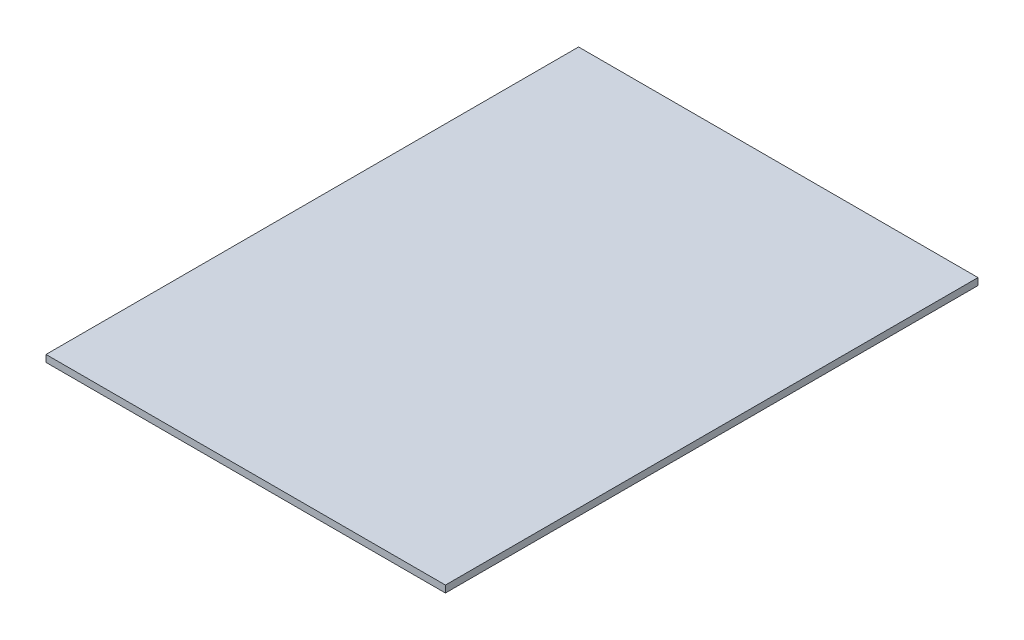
ISO-10303-21;
HEADER;
FILE_DESCRIPTION(('STEP AP214'),'2;1');
FILE_NAME('part.step','',(''),(''),'','','');
FILE_SCHEMA(('AUTOMOTIVE_DESIGN { 1 0 10303 214 1 1 1 1 }'));
ENDSEC;
DATA;
#1=APPLICATION_CONTEXT('core data for automotive mechanical design processes');
#2=APPLICATION_PROTOCOL_DEFINITION('international standard','automotive_design',2000,#1);
#3=PRODUCT_CONTEXT('',#1,'mechanical');
#4=PRODUCT('Part','Part','',(#3));
#5=PRODUCT_RELATED_PRODUCT_CATEGORY('part','',(#4));
#6=PRODUCT_DEFINITION_FORMATION('','',#4);
#7=PRODUCT_DEFINITION_CONTEXT('part definition',#1,'design');
#8=PRODUCT_DEFINITION('design','',#6,#7);
#9=PRODUCT_DEFINITION_SHAPE('','',#8);
#10=(LENGTH_UNIT() NAMED_UNIT(*) SI_UNIT(.MILLI.,.METRE.));
#11=(NAMED_UNIT(*) PLANE_ANGLE_UNIT() SI_UNIT($,.RADIAN.));
#12=(NAMED_UNIT(*) SI_UNIT($,.STERADIAN.) SOLID_ANGLE_UNIT());
#13=UNCERTAINTY_MEASURE_WITH_UNIT(LENGTH_MEASURE(1.E-05),#10,'distance_accuracy_value','');
#14=(GEOMETRIC_REPRESENTATION_CONTEXT(3) GLOBAL_UNCERTAINTY_ASSIGNED_CONTEXT((#13)) GLOBAL_UNIT_ASSIGNED_CONTEXT((#10,
#11,#12)) REPRESENTATION_CONTEXT('',''));
#15=CARTESIAN_POINT('',(0.,0.,0.));
#16=DIRECTION('',(0.,0.,1.));
#17=DIRECTION('',(1.,0.,0.));
#18=AXIS2_PLACEMENT_3D('',#15,#16,#17);
#19=CARTESIAN_POINT('',(342.9,11.90625,457.2));
#20=DIRECTION('',(-1.,0.,0.));
#21=DIRECTION('',(0.,0.,1.));
#22=AXIS2_PLACEMENT_3D('',#19,#20,#21);
#23=PLANE('',#22);
#24=DIRECTION('',(0.,0.,-1.));
#25=VECTOR('',#24,1.);
#26=CARTESIAN_POINT('',(342.9,0.,457.2));
#27=LINE('',#26,#25);
#28=CARTESIAN_POINT('',(342.9,0.,457.2));
#29=VERTEX_POINT('',#28);
#30=CARTESIAN_POINT('',(342.9,0.,-457.2));
#31=VERTEX_POINT('',#30);
#32=EDGE_CURVE('E95',#29,#31,#27,.T.);
#33=ORIENTED_EDGE('',*,*,#32,.T.);
#34=DIRECTION('',(0.,-1.,0.));
#35=VECTOR('',#34,1.);
#36=CARTESIAN_POINT('',(342.9,11.90625,-457.2));
#37=LINE('',#36,#35);
#38=CARTESIAN_POINT('',(342.9,11.90625,-457.2));
#39=VERTEX_POINT('',#38);
#40=EDGE_CURVE('E11',#39,#31,#37,.T.);
#41=ORIENTED_EDGE('',*,*,#40,.F.);
#42=DIRECTION('',(0.,0.,-1.));
#43=VECTOR('',#42,1.);
#44=CARTESIAN_POINT('',(342.9,11.90625,457.2));
#45=LINE('',#44,#43);
#46=CARTESIAN_POINT('',(342.9,11.90625,457.2));
#47=VERTEX_POINT('',#46);
#48=EDGE_CURVE('E83',#47,#39,#45,.T.);
#49=ORIENTED_EDGE('',*,*,#48,.F.);
#50=DIRECTION('',(0.,-1.,0.));
#51=VECTOR('',#50,1.);
#52=CARTESIAN_POINT('',(342.9,11.90625,457.2));
#53=LINE('',#52,#51);
#54=EDGE_CURVE('E91',#47,#29,#53,.T.);
#55=ORIENTED_EDGE('',*,*,#54,.T.);
#56=EDGE_LOOP('',(#33,#41,#49,#55));
#57=FACE_BOUND('',#56,.T.);
#58=ADVANCED_FACE('F32',(#57),#23,.F.);
#59=CARTESIAN_POINT('',(-342.9,11.90625,-457.2));
#60=DIRECTION('',(0.,0.,1.));
#61=DIRECTION('',(1.,0.,0.));
#62=AXIS2_PLACEMENT_3D('',#59,#60,#61);
#63=PLANE('',#62);
#64=DIRECTION('',(-1.,0.,0.));
#65=VECTOR('',#64,1.);
#66=CARTESIAN_POINT('',(-342.9,0.,-457.2));
#67=LINE('',#66,#65);
#68=CARTESIAN_POINT('',(-342.9,0.,-457.2));
#69=VERTEX_POINT('',#68);
#70=EDGE_CURVE('E87',#31,#69,#67,.T.);
#71=ORIENTED_EDGE('',*,*,#70,.T.);
#72=DIRECTION('',(0.,-1.,0.));
#73=VECTOR('',#72,1.);
#74=CARTESIAN_POINT('',(-342.9,11.90625,-457.2));
#75=LINE('',#74,#73);
#76=CARTESIAN_POINT('',(-342.9,11.90625,-457.2));
#77=VERTEX_POINT('',#76);
#78=EDGE_CURVE('E40',#77,#69,#75,.T.);
#79=ORIENTED_EDGE('',*,*,#78,.F.);
#80=DIRECTION('',(-1.,0.,0.));
#81=VECTOR('',#80,1.);
#82=CARTESIAN_POINT('',(-342.9,11.90625,-457.2));
#83=LINE('',#82,#81);
#84=EDGE_CURVE('E78',#39,#77,#83,.T.);
#85=ORIENTED_EDGE('',*,*,#84,.F.);
#86=ORIENTED_EDGE('',*,*,#40,.T.);
#87=EDGE_LOOP('',(#71,#79,#85,#86));
#88=FACE_BOUND('',#87,.T.);
#89=ADVANCED_FACE('F86',(#88),#63,.F.);
#90=CARTESIAN_POINT('',(-342.9,11.90625,457.2));
#91=DIRECTION('',(1.,0.,0.));
#92=DIRECTION('',(0.,0.,-1.));
#93=AXIS2_PLACEMENT_3D('',#90,#91,#92);
#94=PLANE('',#93);
#95=DIRECTION('',(0.,0.,1.));
#96=VECTOR('',#95,1.);
#97=CARTESIAN_POINT('',(-342.9,0.,457.2));
#98=LINE('',#97,#96);
#99=CARTESIAN_POINT('',(-342.9,0.,457.2));
#100=VERTEX_POINT('',#99);
#101=EDGE_CURVE('E65',#69,#100,#98,.T.);
#102=ORIENTED_EDGE('',*,*,#101,.T.);
#103=DIRECTION('',(0.,-1.,0.));
#104=VECTOR('',#103,1.);
#105=CARTESIAN_POINT('',(-342.9,11.90625,457.2));
#106=LINE('',#105,#104);
#107=CARTESIAN_POINT('',(-342.9,11.90625,457.2));
#108=VERTEX_POINT('',#107);
#109=EDGE_CURVE('E88',#108,#100,#106,.T.);
#110=ORIENTED_EDGE('',*,*,#109,.F.);
#111=DIRECTION('',(0.,0.,1.));
#112=VECTOR('',#111,1.);
#113=CARTESIAN_POINT('',(-342.9,11.90625,457.2));
#114=LINE('',#113,#112);
#115=EDGE_CURVE('E81',#77,#108,#114,.T.);
#116=ORIENTED_EDGE('',*,*,#115,.F.);
#117=ORIENTED_EDGE('',*,*,#78,.T.);
#118=EDGE_LOOP('',(#102,#110,#116,#117));
#119=FACE_BOUND('',#118,.T.);
#120=ADVANCED_FACE('F89',(#119),#94,.F.);
#121=CARTESIAN_POINT('',(-342.9,11.90625,457.2));
#122=DIRECTION('',(0.,0.,-1.));
#123=DIRECTION('',(-1.,0.,0.));
#124=AXIS2_PLACEMENT_3D('',#121,#122,#123);
#125=PLANE('',#124);
#126=DIRECTION('',(1.,0.,0.));
#127=VECTOR('',#126,1.);
#128=CARTESIAN_POINT('',(-342.9,0.,457.2));
#129=LINE('',#128,#127);
#130=EDGE_CURVE('E71',#100,#29,#129,.T.);
#131=ORIENTED_EDGE('',*,*,#130,.T.);
#132=ORIENTED_EDGE('',*,*,#54,.F.);
#133=DIRECTION('',(1.,0.,0.));
#134=VECTOR('',#133,1.);
#135=CARTESIAN_POINT('',(-342.9,11.90625,457.2));
#136=LINE('',#135,#134);
#137=EDGE_CURVE('E48',#108,#47,#136,.T.);
#138=ORIENTED_EDGE('',*,*,#137,.F.);
#139=ORIENTED_EDGE('',*,*,#109,.T.);
#140=EDGE_LOOP('',(#131,#132,#138,#139));
#141=FACE_BOUND('',#140,.T.);
#142=ADVANCED_FACE('F102',(#141),#125,.F.);
#143=CARTESIAN_POINT('',(0.,11.90625,0.));
#144=DIRECTION('',(0.,-1.,0.));
#145=DIRECTION('',(0.,0.,-1.));
#146=AXIS2_PLACEMENT_3D('',#143,#144,#145);
#147=PLANE('',#146);
#148=ORIENTED_EDGE('',*,*,#48,.T.);
#149=ORIENTED_EDGE('',*,*,#84,.T.);
#150=ORIENTED_EDGE('',*,*,#115,.T.);
#151=ORIENTED_EDGE('',*,*,#137,.T.);
#152=EDGE_LOOP('',(#148,#149,#150,#151));
#153=FACE_BOUND('',#152,.T.);
#154=ADVANCED_FACE('F79',(#153),#147,.F.);
#155=CARTESIAN_POINT('',(0.,0.,0.));
#156=DIRECTION('',(0.,-1.,0.));
#157=DIRECTION('',(0.,0.,-1.));
#158=AXIS2_PLACEMENT_3D('',#155,#156,#157);
#159=PLANE('',#158);
#160=ORIENTED_EDGE('',*,*,#32,.F.);
#161=ORIENTED_EDGE('',*,*,#130,.F.);
#162=ORIENTED_EDGE('',*,*,#101,.F.);
#163=ORIENTED_EDGE('',*,*,#70,.F.);
#164=EDGE_LOOP('',(#160,#161,#162,#163));
#165=FACE_BOUND('',#164,.T.);
#166=ADVANCED_FACE('F105',(#165),#159,.T.);
#167=CLOSED_SHELL('',(#58,#89,#120,#142,#154,#166));
#168=MANIFOLD_SOLID_BREP('B2',#167);
#169=ADVANCED_BREP_SHAPE_REPRESENTATION('',(#18,#168),#14);
#170=SHAPE_DEFINITION_REPRESENTATION(#9,#169);
ENDSEC;
END-ISO-10303-21;
